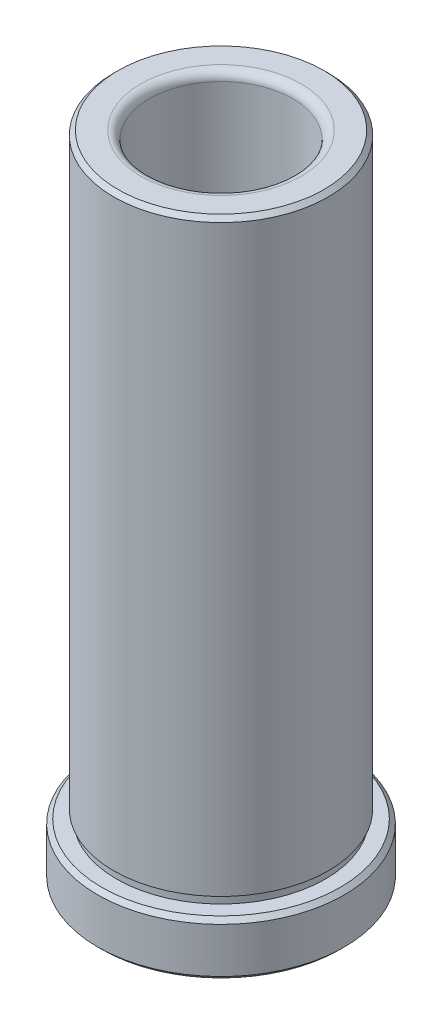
ISO-10303-21;
HEADER;
FILE_DESCRIPTION(('STEP AP214'),'2;1');
FILE_NAME('part.step','',(''),(''),'','','');
FILE_SCHEMA(('AUTOMOTIVE_DESIGN { 1 0 10303 214 1 1 1 1 }'));
ENDSEC;
DATA;
#1=APPLICATION_CONTEXT('core data for automotive mechanical design processes');
#2=APPLICATION_PROTOCOL_DEFINITION('international standard','automotive_design',2000,#1);
#3=PRODUCT_CONTEXT('',#1,'mechanical');
#4=PRODUCT('Part','Part','',(#3));
#5=PRODUCT_RELATED_PRODUCT_CATEGORY('part','',(#4));
#6=PRODUCT_DEFINITION_FORMATION('','',#4);
#7=PRODUCT_DEFINITION_CONTEXT('part definition',#1,'design');
#8=PRODUCT_DEFINITION('design','',#6,#7);
#9=PRODUCT_DEFINITION_SHAPE('','',#8);
#10=(LENGTH_UNIT() NAMED_UNIT(*) SI_UNIT(.MILLI.,.METRE.));
#11=(NAMED_UNIT(*) PLANE_ANGLE_UNIT() SI_UNIT($,.RADIAN.));
#12=(NAMED_UNIT(*) SI_UNIT($,.STERADIAN.) SOLID_ANGLE_UNIT());
#13=UNCERTAINTY_MEASURE_WITH_UNIT(LENGTH_MEASURE(1.E-05),#10,'distance_accuracy_value','');
#14=(GEOMETRIC_REPRESENTATION_CONTEXT(3) GLOBAL_UNCERTAINTY_ASSIGNED_CONTEXT((#13)) GLOBAL_UNIT_ASSIGNED_CONTEXT((#10,
#11,#12)) REPRESENTATION_CONTEXT('',''));
#15=CARTESIAN_POINT('',(0.,0.,0.));
#16=DIRECTION('',(0.,0.,1.));
#17=DIRECTION('',(1.,0.,0.));
#18=AXIS2_PLACEMENT_3D('',#15,#16,#17);
#19=CARTESIAN_POINT('',(6.3627,57.785,0.));
#20=DIRECTION('',(0.,-1.,0.));
#21=DIRECTION('',(0.,0.,-1.));
#22=AXIS2_PLACEMENT_3D('',#19,#20,#21);
#23=PLANE('',#22);
#24=CARTESIAN_POINT('',(0.,57.785,0.));
#25=DIRECTION('',(0.,-1.,0.));
#26=DIRECTION('',(0.,0.,-1.));
#27=AXIS2_PLACEMENT_3D('',#24,#25,#26);
#28=CIRCLE('',#27,9.15670000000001);
#29=CARTESIAN_POINT('',(0.,57.785,-9.15670000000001));
#30=VERTEX_POINT('',#29);
#31=EDGE_CURVE('E39',#30,#30,#28,.F.);
#32=ORIENTED_EDGE('',*,*,#31,.T.);
#33=EDGE_LOOP('',(#32));
#34=FACE_BOUND('',#33,.T.);
#35=CARTESIAN_POINT('',(0.,57.785,0.));
#36=DIRECTION('',(0.,-1.,0.));
#37=DIRECTION('',(0.,0.,-1.));
#38=AXIS2_PLACEMENT_3D('',#35,#36,#37);
#39=CIRCLE('',#38,7.1247);
#40=CARTESIAN_POINT('',(0.,57.785,-7.1247));
#41=VERTEX_POINT('',#40);
#42=EDGE_CURVE('E64',#41,#41,#39,.T.);
#43=ORIENTED_EDGE('',*,*,#42,.T.);
#44=EDGE_LOOP('',(#43));
#45=FACE_BOUND('',#44,.T.);
#46=ADVANCED_FACE('F32',(#34,#45),#23,.F.);
#47=CARTESIAN_POINT('',(0.,33.4632535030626,0.));
#48=DIRECTION('',(0.,1.,0.));
#49=DIRECTION('',(0.,0.,1.));
#50=AXIS2_PLACEMENT_3D('',#47,#48,#49);
#51=CYLINDRICAL_SURFACE('',#50,9.5377);
#52=CARTESIAN_POINT('',(0.,57.404,0.));
#53=DIRECTION('',(0.,-1.,0.));
#54=DIRECTION('',(0.,0.,-1.));
#55=AXIS2_PLACEMENT_3D('',#52,#53,#54);
#56=CIRCLE('',#55,9.5377);
#57=CARTESIAN_POINT('',(0.,57.404,-9.5377));
#58=VERTEX_POINT('',#57);
#59=EDGE_CURVE('E10',#58,#58,#56,.T.);
#60=ORIENTED_EDGE('',*,*,#59,.T.);
#61=EDGE_LOOP('',(#60));
#62=FACE_BOUND('',#61,.T.);
#63=CARTESIAN_POINT('',(0.,5.5372,0.));
#64=DIRECTION('',(0.,1.,0.));
#65=DIRECTION('',(0.,0.,1.));
#66=AXIS2_PLACEMENT_3D('',#63,#64,#65);
#67=CIRCLE('',#66,9.5377);
#68=CARTESIAN_POINT('',(0.,5.5372,9.5377));
#69=VERTEX_POINT('',#68);
#70=EDGE_CURVE('E70',#69,#69,#67,.T.);
#71=ORIENTED_EDGE('',*,*,#70,.T.);
#72=EDGE_LOOP('',(#71));
#73=FACE_BOUND('',#72,.T.);
#74=ADVANCED_FACE('F98',(#62,#73),#51,.T.);
#75=CARTESIAN_POINT('',(9.5377,5.5372,0.));
#76=DIRECTION('',(0.,1.,0.));
#77=DIRECTION('',(0.,0.,1.));
#78=AXIS2_PLACEMENT_3D('',#75,#76,#77);
#79=PLANE('',#78);
#80=ORIENTED_EDGE('',*,*,#70,.F.);
#81=EDGE_LOOP('',(#80));
#82=FACE_BOUND('',#81,.T.);
#83=CARTESIAN_POINT('',(0.,5.5372,0.));
#84=DIRECTION('',(0.,1.,0.));
#85=DIRECTION('',(0.,0.,1.));
#86=AXIS2_PLACEMENT_3D('',#83,#84,#85);
#87=CIRCLE('',#86,9.2837);
#88=CARTESIAN_POINT('',(0.,5.5372,9.2837));
#89=VERTEX_POINT('',#88);
#90=EDGE_CURVE('E73',#89,#89,#87,.T.);
#91=ORIENTED_EDGE('',*,*,#90,.T.);
#92=EDGE_LOOP('',(#91));
#93=FACE_BOUND('',#92,.T.);
#94=ADVANCED_FACE('F94',(#82,#93),#79,.F.);
#95=CARTESIAN_POINT('',(0.,33.4632535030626,0.));
#96=DIRECTION('',(0.,1.,0.));
#97=DIRECTION('',(0.,0.,1.));
#98=AXIS2_PLACEMENT_3D('',#95,#96,#97);
#99=CYLINDRICAL_SURFACE('',#98,9.2837);
#100=ORIENTED_EDGE('',*,*,#90,.F.);
#101=EDGE_LOOP('',(#100));
#102=FACE_BOUND('',#101,.T.);
#103=CARTESIAN_POINT('',(0.,4.7752,0.));
#104=DIRECTION('',(0.,1.,0.));
#105=DIRECTION('',(0.,0.,1.));
#106=AXIS2_PLACEMENT_3D('',#103,#104,#105);
#107=CIRCLE('',#106,9.2837);
#108=CARTESIAN_POINT('',(0.,4.7752,9.2837));
#109=VERTEX_POINT('',#108);
#110=EDGE_CURVE('E76',#109,#109,#107,.T.);
#111=ORIENTED_EDGE('',*,*,#110,.T.);
#112=EDGE_LOOP('',(#111));
#113=FACE_BOUND('',#112,.T.);
#114=ADVANCED_FACE('F80',(#102,#113),#99,.T.);
#115=CARTESIAN_POINT('',(9.2837,4.7752,0.));
#116=DIRECTION('',(0.,-1.,0.));
#117=DIRECTION('',(0.,0.,-1.));
#118=AXIS2_PLACEMENT_3D('',#115,#116,#117);
#119=PLANE('',#118);
#120=CARTESIAN_POINT('',(0.,4.7752,0.));
#121=DIRECTION('',(0.,-1.,0.));
#122=DIRECTION('',(0.,0.,-1.));
#123=AXIS2_PLACEMENT_3D('',#120,#121,#122);
#124=CIRCLE('',#123,10.5791);
#125=CARTESIAN_POINT('',(0.,4.7752,-10.5791));
#126=VERTEX_POINT('',#125);
#127=EDGE_CURVE('E43',#126,#126,#124,.F.);
#128=ORIENTED_EDGE('',*,*,#127,.T.);
#129=EDGE_LOOP('',(#128));
#130=FACE_BOUND('',#129,.T.);
#131=ORIENTED_EDGE('',*,*,#110,.F.);
#132=EDGE_LOOP('',(#131));
#133=FACE_BOUND('',#132,.T.);
#134=ADVANCED_FACE('F82',(#130,#133),#119,.F.);
#135=CARTESIAN_POINT('',(0.,33.4632535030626,0.));
#136=DIRECTION('',(0.,1.,0.));
#137=DIRECTION('',(0.,0.,1.));
#138=AXIS2_PLACEMENT_3D('',#135,#136,#137);
#139=CYLINDRICAL_SURFACE('',#138,10.9601);
#140=CARTESIAN_POINT('',(0.,0.380999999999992,0.));
#141=DIRECTION('',(0.,1.,0.));
#142=DIRECTION('',(0.,0.,1.));
#143=AXIS2_PLACEMENT_3D('',#140,#141,#142);
#144=CIRCLE('',#143,10.9601);
#145=CARTESIAN_POINT('',(0.,0.380999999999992,10.9601));
#146=VERTEX_POINT('',#145);
#147=EDGE_CURVE('E52',#146,#146,#144,.T.);
#148=ORIENTED_EDGE('',*,*,#147,.T.);
#149=EDGE_LOOP('',(#148));
#150=FACE_BOUND('',#149,.T.);
#151=CARTESIAN_POINT('',(0.,4.3942,0.));
#152=DIRECTION('',(0.,-1.,0.));
#153=DIRECTION('',(0.,0.,-1.));
#154=AXIS2_PLACEMENT_3D('',#151,#152,#153);
#155=CIRCLE('',#154,10.9601);
#156=CARTESIAN_POINT('',(0.,4.3942,-10.9601));
#157=VERTEX_POINT('',#156);
#158=EDGE_CURVE('E55',#157,#157,#155,.T.);
#159=ORIENTED_EDGE('',*,*,#158,.T.);
#160=EDGE_LOOP('',(#159));
#161=FACE_BOUND('',#160,.T.);
#162=ADVANCED_FACE('F84',(#150,#161),#139,.T.);
#163=CARTESIAN_POINT('',(10.9601,0.,0.));
#164=DIRECTION('',(0.,1.,0.));
#165=DIRECTION('',(0.,0.,1.));
#166=AXIS2_PLACEMENT_3D('',#163,#164,#165);
#167=PLANE('',#166);
#168=CARTESIAN_POINT('',(0.,0.,0.));
#169=DIRECTION('',(0.,1.,0.));
#170=DIRECTION('',(0.,0.,1.));
#171=AXIS2_PLACEMENT_3D('',#168,#169,#170);
#172=CIRCLE('',#171,10.5791);
#173=CARTESIAN_POINT('',(0.,0.,10.5791));
#174=VERTEX_POINT('',#173);
#175=EDGE_CURVE('E47',#174,#174,#172,.F.);
#176=ORIENTED_EDGE('',*,*,#175,.T.);
#177=EDGE_LOOP('',(#176));
#178=FACE_BOUND('',#177,.T.);
#179=CARTESIAN_POINT('',(0.,0.,0.));
#180=DIRECTION('',(0.,1.,0.));
#181=DIRECTION('',(0.,0.,1.));
#182=AXIS2_PLACEMENT_3D('',#179,#180,#181);
#183=CIRCLE('',#182,7.1247);
#184=CARTESIAN_POINT('',(0.,0.,7.1247));
#185=VERTEX_POINT('',#184);
#186=EDGE_CURVE('E61',#185,#185,#183,.T.);
#187=ORIENTED_EDGE('',*,*,#186,.T.);
#188=EDGE_LOOP('',(#187));
#189=FACE_BOUND('',#188,.T.);
#190=ADVANCED_FACE('F91',(#178,#189),#167,.F.);
#191=CARTESIAN_POINT('',(0.,33.4632535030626,0.));
#192=DIRECTION('',(0.,1.,0.));
#193=DIRECTION('',(0.,0.,1.));
#194=AXIS2_PLACEMENT_3D('',#191,#192,#193);
#195=CYLINDRICAL_SURFACE('',#194,6.3627);
#196=CARTESIAN_POINT('',(0.,0.761999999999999,0.));
#197=DIRECTION('',(0.,1.,0.));
#198=DIRECTION('',(0.,0.,1.));
#199=AXIS2_PLACEMENT_3D('',#196,#197,#198);
#200=CIRCLE('',#199,6.3627);
#201=CARTESIAN_POINT('',(0.,0.761999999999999,6.3627));
#202=VERTEX_POINT('',#201);
#203=EDGE_CURVE('E58',#202,#202,#200,.F.);
#204=ORIENTED_EDGE('',*,*,#203,.T.);
#205=EDGE_LOOP('',(#204));
#206=FACE_BOUND('',#205,.T.);
#207=CARTESIAN_POINT('',(0.,57.023,0.));
#208=DIRECTION('',(0.,-1.,0.));
#209=DIRECTION('',(0.,0.,-1.));
#210=AXIS2_PLACEMENT_3D('',#207,#208,#209);
#211=CIRCLE('',#210,6.3627);
#212=CARTESIAN_POINT('',(0.,57.023,-6.3627));
#213=VERTEX_POINT('',#212);
#214=EDGE_CURVE('E67',#213,#213,#211,.F.);
#215=ORIENTED_EDGE('',*,*,#214,.T.);
#216=EDGE_LOOP('',(#215));
#217=FACE_BOUND('',#216,.T.);
#218=ADVANCED_FACE('F111',(#206,#217),#195,.F.);
#219=CARTESIAN_POINT('',(0.,57.023,0.));
#220=DIRECTION('',(0.,-1.,0.));
#221=DIRECTION('',(0.,0.,-1.));
#222=AXIS2_PLACEMENT_3D('',#219,#220,#221);
#223=TOROIDAL_SURFACE('',#222,7.1247,0.762);
#224=ORIENTED_EDGE('',*,*,#42,.F.);
#225=EDGE_LOOP('',(#224));
#226=FACE_BOUND('',#225,.T.);
#227=ORIENTED_EDGE('',*,*,#214,.F.);
#228=EDGE_LOOP('',(#227));
#229=FACE_BOUND('',#228,.T.);
#230=ADVANCED_FACE('F107',(#226,#229),#223,.T.);
#231=CARTESIAN_POINT('',(0.,0.,0.));
#232=DIRECTION('',(0.,-1.,0.));
#233=DIRECTION('',(0.,0.,-1.));
#234=AXIS2_PLACEMENT_3D('',#231,#232,#233);
#235=CONICAL_SURFACE('',#234,7.1247,0.785398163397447);
#236=ORIENTED_EDGE('',*,*,#203,.F.);
#237=EDGE_LOOP('',(#236));
#238=FACE_BOUND('',#237,.T.);
#239=ORIENTED_EDGE('',*,*,#186,.F.);
#240=EDGE_LOOP('',(#239));
#241=FACE_BOUND('',#240,.T.);
#242=ADVANCED_FACE('F110',(#238,#241),#235,.F.);
#243=CARTESIAN_POINT('',(0.,0.380999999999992,0.));
#244=DIRECTION('',(0.,1.,0.));
#245=DIRECTION('',(0.,0.,1.));
#246=AXIS2_PLACEMENT_3D('',#243,#244,#245);
#247=CONICAL_SURFACE('',#246,10.9601,0.785398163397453);
#248=ORIENTED_EDGE('',*,*,#175,.F.);
#249=EDGE_LOOP('',(#248));
#250=FACE_BOUND('',#249,.T.);
#251=ORIENTED_EDGE('',*,*,#147,.F.);
#252=EDGE_LOOP('',(#251));
#253=FACE_BOUND('',#252,.T.);
#254=ADVANCED_FACE('F115',(#250,#253),#247,.T.);
#255=CARTESIAN_POINT('',(0.,4.7752,0.));
#256=DIRECTION('',(0.,-1.,0.));
#257=DIRECTION('',(0.,0.,-1.));
#258=AXIS2_PLACEMENT_3D('',#255,#256,#257);
#259=CONICAL_SURFACE('',#258,10.5791,0.785398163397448);
#260=ORIENTED_EDGE('',*,*,#158,.F.);
#261=EDGE_LOOP('',(#260));
#262=FACE_BOUND('',#261,.T.);
#263=ORIENTED_EDGE('',*,*,#127,.F.);
#264=EDGE_LOOP('',(#263));
#265=FACE_BOUND('',#264,.T.);
#266=ADVANCED_FACE('F118',(#262,#265),#259,.T.);
#267=CARTESIAN_POINT('',(0.,57.785,0.));
#268=DIRECTION('',(0.,-1.,0.));
#269=DIRECTION('',(0.,0.,-1.));
#270=AXIS2_PLACEMENT_3D('',#267,#268,#269);
#271=CONICAL_SURFACE('',#270,9.15670000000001,0.785398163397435);
#272=ORIENTED_EDGE('',*,*,#59,.F.);
#273=EDGE_LOOP('',(#272));
#274=FACE_BOUND('',#273,.T.);
#275=ORIENTED_EDGE('',*,*,#31,.F.);
#276=EDGE_LOOP('',(#275));
#277=FACE_BOUND('',#276,.T.);
#278=ADVANCED_FACE('F34',(#274,#277),#271,.T.);
#279=CLOSED_SHELL('',(#46,#74,#94,#114,#134,#162,#190,#218,#230,#242,#254,#266,#278));
#280=MANIFOLD_SOLID_BREP('B2',#279);
#281=ADVANCED_BREP_SHAPE_REPRESENTATION('',(#18,#280),#14);
#282=SHAPE_DEFINITION_REPRESENTATION(#9,#281);
ENDSEC;
END-ISO-10303-21;
